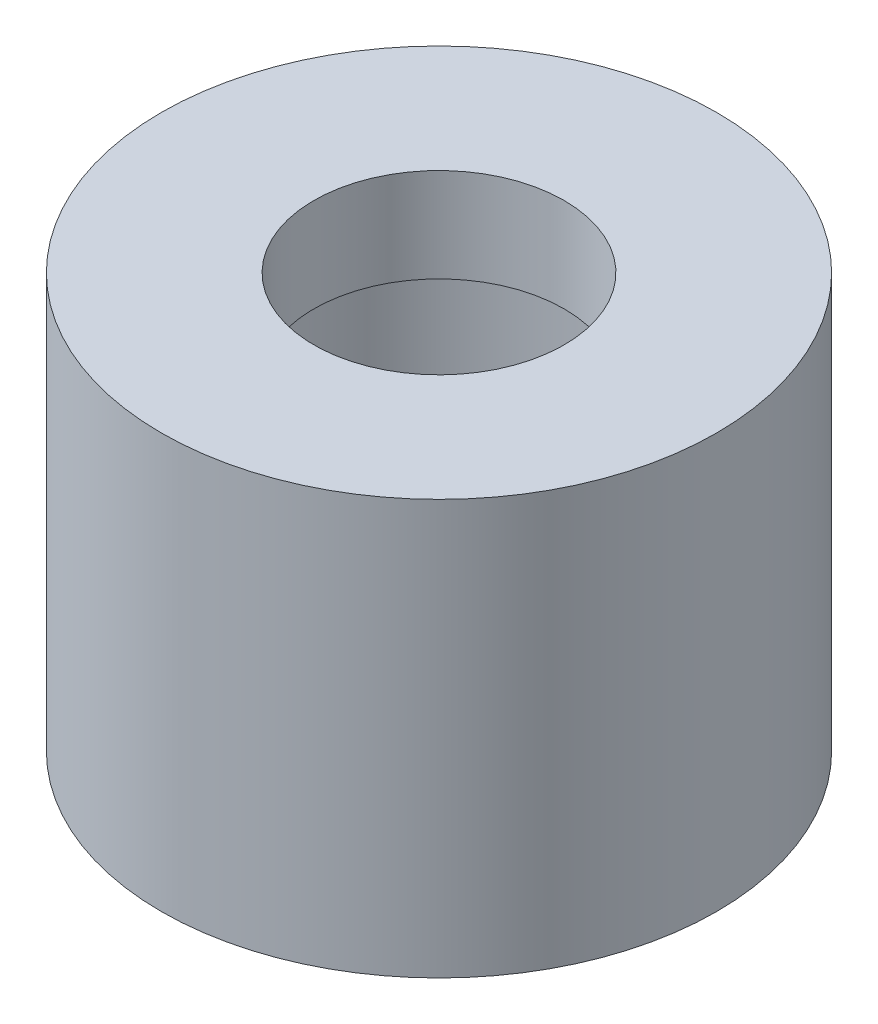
from build123d import *


with BuildPart() as part:
    # Sketch1 → Revolve1 (revolve)
    with BuildSketch(Plane.XY, mode=Mode.PRIVATE) as revolve1_sk:
        Polygon((-9.017, 0), (-5.715, 0), (-5.715, 10.414), (-4.064, 10.414), (-4.064, 13.462), (-9.017, 13.462), align=None)
    revolve(revolve1_sk.sketch.rotate(Axis((0, 0, 0), (0, 1, 0)), 270), axis=Axis((0, 0, 0), (0, 1, 0)))


solid = part.part
